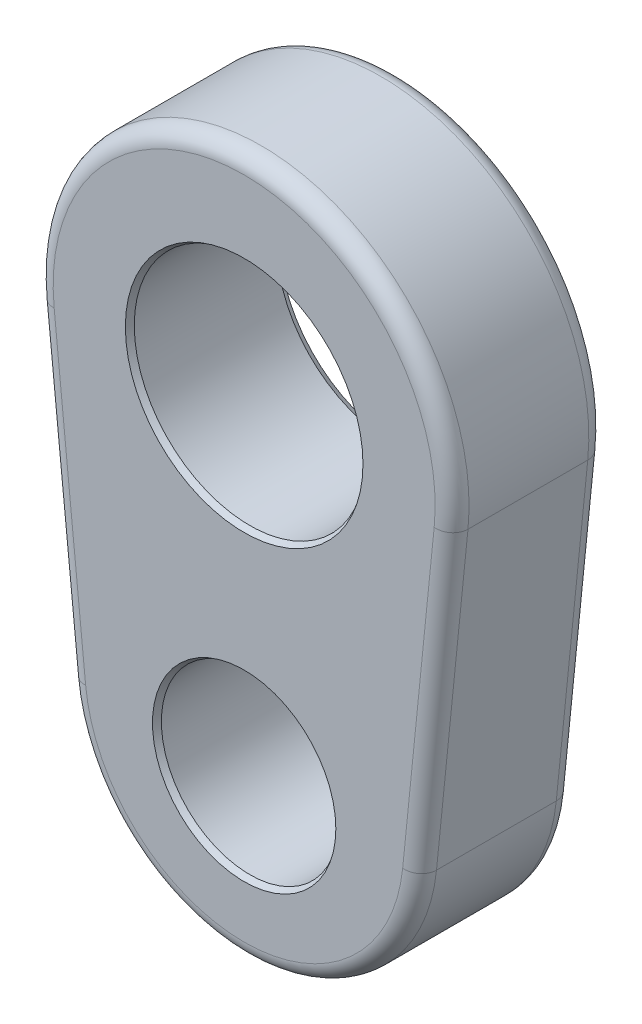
from build123d import *
from OCP.BRepFilletAPI import BRepFilletAPI_MakeChamfer

# Parameters (mm, degrees)
SKETCH1_R      = 2.59715
SKETCH1_R_2    = 1.98755
EXTRUDE1_DEPTH = 1.7272
CHAMFER1_SIZE  = 0.127
CHAMFER1_SIZE2 = 0.073323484
CHAMFER2_SIZE  = 0.127
CHAMFER2_SIZE2 = 0.073323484
FILLET1_R      = 0.381


with BuildPart() as part:
    # Sketch1 → Extrude1 (new, symmetric)
    with BuildSketch(Plane.XY):
        with BuildLine():
            Line((3.942250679, -7.460290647), (4.649834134, -0.470722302))
            ThreePointArc((4.649834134, -0.470722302), (0, 4.6736), (-4.649834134, -0.470722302))
            Line((-4.649834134, -0.470722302), (-3.942250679, -7.460290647))
            ThreePointArc((-3.942250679, -7.460290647), (0, -11.0236), (3.942250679, -7.460290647))
        make_face()
        Circle(SKETCH1_R, mode=Mode.SUBTRACT)
        with Locations((0, -7.405624)):
            Circle(SKETCH1_R_2, mode=Mode.SUBTRACT)
    extrude(amount=EXTRUDE1_DEPTH, both=True)

    # Chamfer1: one chamfer whose edges measure the first distance from different faces: ONE call of the kernel's chamfer builder (chamfer() names one face for all edges)
    chamfer1_edges_1 = [part.edges().sort_by_distance(p)[0] for p in [
        (-2.59715, 0, 1.7272),
    ]]
    chamfer1_side_1 = [part.faces().sort_by_distance(p)[0] for p in [
        (-2.59715, 0, 0),
    ]]
    chamfer1_edges_2 = [part.edges().sort_by_distance(p)[0] for p in [
        (-1.98755, -7.405624, 1.7272),
    ]]
    chamfer1_side_2 = [part.faces().sort_by_distance(p)[0] for p in [
        (-1.98755, -7.405624, 0),
    ]]
    chamfer1 = BRepFilletAPI_MakeChamfer(part.part.solid().wrapped)
    for e in chamfer1_edges_1:
        chamfer1.Add(CHAMFER1_SIZE, CHAMFER1_SIZE2, e.wrapped, chamfer1_side_1[0].wrapped)  # the first distance lies on this face
    for e in chamfer1_edges_2:
        chamfer1.Add(CHAMFER1_SIZE, CHAMFER1_SIZE2, e.wrapped, chamfer1_side_2[0].wrapped)  # the first distance lies on this face
    add(Compound.cast(chamfer1.Shape()), mode=Mode.REPLACE)

    # Chamfer2: one chamfer whose edges measure the first distance from different faces: ONE call of the kernel's chamfer builder (chamfer() names one face for all edges)
    chamfer2_edges_1 = [part.edges().sort_by_distance(p)[0] for p in [
        (-2.59715, 0, -1.7272),
    ]]
    chamfer2_side_1 = [part.faces().sort_by_distance(p)[0] for p in [
        (-2.59715, 0, -0.0635),
    ]]
    chamfer2_edges_2 = [part.edges().sort_by_distance(p)[0] for p in [
        (-1.98755, -7.405624, -1.7272),
    ]]
    chamfer2_side_2 = [part.faces().sort_by_distance(p)[0] for p in [
        (-1.98755, -7.405624, -0.0635),
    ]]
    chamfer2 = BRepFilletAPI_MakeChamfer(part.part.solid().wrapped)
    for e in chamfer2_edges_1:
        chamfer2.Add(CHAMFER2_SIZE, CHAMFER2_SIZE2, e.wrapped, chamfer2_side_1[0].wrapped)  # the first distance lies on this face
    for e in chamfer2_edges_2:
        chamfer2.Add(CHAMFER2_SIZE, CHAMFER2_SIZE2, e.wrapped, chamfer2_side_2[0].wrapped)  # the first distance lies on this face
    add(Compound.cast(chamfer2.Shape()), mode=Mode.REPLACE)

    # Fillet1
    fillet1_edges = [part.edges().sort_by_distance(p)[0] for p in [
        (0, 4.6736, 1.7272),
        (-4.296042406, -3.965506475, 1.7272),
        (0, -11.0236, 1.7272),
        (-4.296042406, -3.965506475, -1.7272),
        (0, 4.6736, -1.7272),
        (4.296042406, -3.965506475, -1.7272),
        (0, -11.0236, -1.7272),
        (4.296042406, -3.965506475, 1.7272),
    ]]
    fillet(fillet1_edges, radius=FILLET1_R)


solid = part.part
